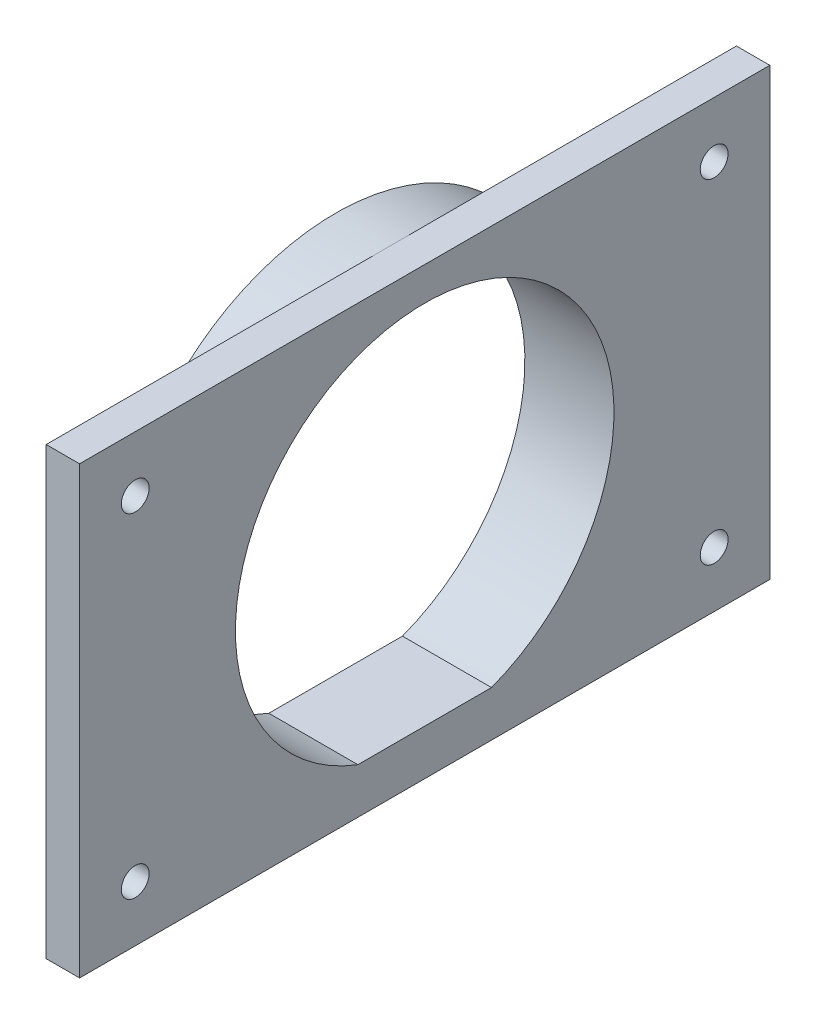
ISO-10303-21;
HEADER;
FILE_DESCRIPTION(('STEP AP214'),'2;1');
FILE_NAME('part.step','',(''),(''),'','','');
FILE_SCHEMA(('AUTOMOTIVE_DESIGN { 1 0 10303 214 1 1 1 1 }'));
ENDSEC;
DATA;
#1=APPLICATION_CONTEXT('core data for automotive mechanical design processes');
#2=APPLICATION_PROTOCOL_DEFINITION('international standard','automotive_design',2000,#1);
#3=PRODUCT_CONTEXT('',#1,'mechanical');
#4=PRODUCT('Part','Part','',(#3));
#5=PRODUCT_RELATED_PRODUCT_CATEGORY('part','',(#4));
#6=PRODUCT_DEFINITION_FORMATION('','',#4);
#7=PRODUCT_DEFINITION_CONTEXT('part definition',#1,'design');
#8=PRODUCT_DEFINITION('design','',#6,#7);
#9=PRODUCT_DEFINITION_SHAPE('','',#8);
#10=(LENGTH_UNIT() NAMED_UNIT(*) SI_UNIT(.MILLI.,.METRE.));
#11=(NAMED_UNIT(*) PLANE_ANGLE_UNIT() SI_UNIT($,.RADIAN.));
#12=(NAMED_UNIT(*) SI_UNIT($,.STERADIAN.) SOLID_ANGLE_UNIT());
#13=UNCERTAINTY_MEASURE_WITH_UNIT(LENGTH_MEASURE(1.E-05),#10,'distance_accuracy_value','');
#14=(GEOMETRIC_REPRESENTATION_CONTEXT(3) GLOBAL_UNCERTAINTY_ASSIGNED_CONTEXT((#13)) GLOBAL_UNIT_ASSIGNED_CONTEXT((#10,
#11,#12)) REPRESENTATION_CONTEXT('',''));
#15=CARTESIAN_POINT('',(0.,0.,0.));
#16=DIRECTION('',(0.,0.,1.));
#17=DIRECTION('',(1.,0.,0.));
#18=AXIS2_PLACEMENT_3D('',#15,#16,#17);
#19=CARTESIAN_POINT('',(-3.,0.,0.));
#20=DIRECTION('',(-1.,0.,0.));
#21=DIRECTION('',(0.,0.,1.));
#22=AXIS2_PLACEMENT_3D('',#19,#20,#21);
#23=PLANE('',#22);
#24=CARTESIAN_POINT('',(-3.,-15.,-26.));
#25=DIRECTION('',(-1.,0.,0.));
#26=DIRECTION('',(0.,0.,1.));
#27=AXIS2_PLACEMENT_3D('',#24,#25,#26);
#28=CIRCLE('',#27,2.25);
#29=CARTESIAN_POINT('',(-3.,-15.,-23.75));
#30=VERTEX_POINT('',#29);
#31=EDGE_CURVE('E168',#30,#30,#28,.F.);
#32=ORIENTED_EDGE('',*,*,#31,.T.);
#33=EDGE_LOOP('',(#32));
#34=FACE_BOUND('',#33,.T.);
#35=CARTESIAN_POINT('',(-3.,15.,-26.));
#36=DIRECTION('',(-1.,0.,0.));
#37=DIRECTION('',(0.,0.,1.));
#38=AXIS2_PLACEMENT_3D('',#35,#36,#37);
#39=CIRCLE('',#38,2.25);
#40=CARTESIAN_POINT('',(-3.,15.,-23.75));
#41=VERTEX_POINT('',#40);
#42=EDGE_CURVE('E165',#41,#41,#39,.F.);
#43=ORIENTED_EDGE('',*,*,#42,.T.);
#44=EDGE_LOOP('',(#43));
#45=FACE_BOUND('',#44,.T.);
#46=DIRECTION('',(0.,0.,-1.));
#47=VECTOR('',#46,1.);
#48=CARTESIAN_POINT('',(-3.,-20.,31.));
#49=LINE('',#48,#47);
#50=CARTESIAN_POINT('',(-3.,-20.,0.));
#51=VERTEX_POINT('',#50);
#52=CARTESIAN_POINT('',(-3.,-20.,-31.));
#53=VERTEX_POINT('',#52);
#54=EDGE_CURVE('E130',#51,#53,#49,.T.);
#55=ORIENTED_EDGE('',*,*,#54,.F.);
#56=CARTESIAN_POINT('',(-3.,0.,0.));
#57=DIRECTION('',(-1.,0.,0.));
#58=DIRECTION('',(0.,0.,1.));
#59=AXIS2_PLACEMENT_3D('',#56,#57,#58);
#60=CIRCLE('',#59,20.);
#61=CARTESIAN_POINT('',(-3.,20.,0.));
#62=VERTEX_POINT('',#61);
#63=EDGE_CURVE('E118',#51,#62,#60,.F.);
#64=ORIENTED_EDGE('',*,*,#63,.T.);
#65=DIRECTION('',(0.,0.,1.));
#66=VECTOR('',#65,1.);
#67=CARTESIAN_POINT('',(-3.,20.,31.));
#68=LINE('',#67,#66);
#69=CARTESIAN_POINT('',(-3.,20.,-31.));
#70=VERTEX_POINT('',#69);
#71=EDGE_CURVE('E124',#70,#62,#68,.T.);
#72=ORIENTED_EDGE('',*,*,#71,.F.);
#73=DIRECTION('',(0.,1.,0.));
#74=VECTOR('',#73,1.);
#75=CARTESIAN_POINT('',(-3.,-20.,-31.));
#76=LINE('',#75,#74);
#77=EDGE_CURVE('E119',#53,#70,#76,.T.);
#78=ORIENTED_EDGE('',*,*,#77,.F.);
#79=EDGE_LOOP('',(#55,#64,#72,#78));
#80=FACE_BOUND('',#79,.T.);
#81=ADVANCED_FACE('F33',(#34,#45,#80),#23,.T.);
#82=CARTESIAN_POINT('',(-3.,-20.,-31.));
#83=DIRECTION('',(0.,0.,-1.));
#84=DIRECTION('',(-1.,0.,0.));
#85=AXIS2_PLACEMENT_3D('',#82,#83,#84);
#86=PLANE('',#85);
#87=DIRECTION('',(0.,1.,0.));
#88=VECTOR('',#87,1.);
#89=CARTESIAN_POINT('',(0.,-20.,-31.));
#90=LINE('',#89,#88);
#91=CARTESIAN_POINT('',(0.,-20.,-31.));
#92=VERTEX_POINT('',#91);
#93=CARTESIAN_POINT('',(0.,20.,-31.));
#94=VERTEX_POINT('',#93);
#95=EDGE_CURVE('E135',#92,#94,#90,.T.);
#96=ORIENTED_EDGE('',*,*,#95,.F.);
#97=DIRECTION('',(1.,0.,0.));
#98=VECTOR('',#97,1.);
#99=CARTESIAN_POINT('',(-3.,-20.,-31.));
#100=LINE('',#99,#98);
#101=EDGE_CURVE('E144',#53,#92,#100,.T.);
#102=ORIENTED_EDGE('',*,*,#101,.F.);
#103=ORIENTED_EDGE('',*,*,#77,.T.);
#104=DIRECTION('',(1.,0.,0.));
#105=VECTOR('',#104,1.);
#106=CARTESIAN_POINT('',(-3.,20.,-31.));
#107=LINE('',#106,#105);
#108=EDGE_CURVE('E134',#70,#94,#107,.T.);
#109=ORIENTED_EDGE('',*,*,#108,.T.);
#110=EDGE_LOOP('',(#96,#102,#103,#109));
#111=FACE_BOUND('',#110,.T.);
#112=ADVANCED_FACE('F190',(#111),#86,.T.);
#113=CARTESIAN_POINT('',(-3.,-20.,31.));
#114=DIRECTION('',(0.,-1.,0.));
#115=DIRECTION('',(0.,0.,-1.));
#116=AXIS2_PLACEMENT_3D('',#113,#114,#115);
#117=PLANE('',#116);
#118=CARTESIAN_POINT('',(-3.,-20.,31.));
#119=VERTEX_POINT('',#118);
#120=EDGE_CURVE('E131',#119,#51,#49,.T.);
#121=ORIENTED_EDGE('',*,*,#120,.T.);
#122=ORIENTED_EDGE('',*,*,#54,.T.);
#123=ORIENTED_EDGE('',*,*,#101,.T.);
#124=DIRECTION('',(0.,0.,-1.));
#125=VECTOR('',#124,1.);
#126=CARTESIAN_POINT('',(0.,-20.,31.));
#127=LINE('',#126,#125);
#128=CARTESIAN_POINT('',(0.,-20.,31.));
#129=VERTEX_POINT('',#128);
#130=EDGE_CURVE('E123',#129,#92,#127,.T.);
#131=ORIENTED_EDGE('',*,*,#130,.F.);
#132=DIRECTION('',(1.,0.,0.));
#133=VECTOR('',#132,1.);
#134=CARTESIAN_POINT('',(-3.,-20.,31.));
#135=LINE('',#134,#133);
#136=EDGE_CURVE('E148',#119,#129,#135,.T.);
#137=ORIENTED_EDGE('',*,*,#136,.F.);
#138=EDGE_LOOP('',(#121,#122,#123,#131,#137));
#139=FACE_BOUND('',#138,.T.);
#140=ADVANCED_FACE('F197',(#139),#117,.T.);
#141=CARTESIAN_POINT('',(-3.,-20.,31.));
#142=DIRECTION('',(0.,0.,1.));
#143=DIRECTION('',(1.,0.,0.));
#144=AXIS2_PLACEMENT_3D('',#141,#142,#143);
#145=PLANE('',#144);
#146=DIRECTION('',(0.,-1.,0.));
#147=VECTOR('',#146,1.);
#148=CARTESIAN_POINT('',(0.,-20.,31.));
#149=LINE('',#148,#147);
#150=CARTESIAN_POINT('',(0.,20.,31.));
#151=VERTEX_POINT('',#150);
#152=EDGE_CURVE('E140',#151,#129,#149,.T.);
#153=ORIENTED_EDGE('',*,*,#152,.F.);
#154=DIRECTION('',(1.,0.,0.));
#155=VECTOR('',#154,1.);
#156=CARTESIAN_POINT('',(-3.,20.,31.));
#157=LINE('',#156,#155);
#158=CARTESIAN_POINT('',(-3.,20.,31.));
#159=VERTEX_POINT('',#158);
#160=EDGE_CURVE('E150',#159,#151,#157,.T.);
#161=ORIENTED_EDGE('',*,*,#160,.F.);
#162=DIRECTION('',(0.,-1.,0.));
#163=VECTOR('',#162,1.);
#164=CARTESIAN_POINT('',(-3.,-20.,31.));
#165=LINE('',#164,#163);
#166=EDGE_CURVE('E127',#159,#119,#165,.T.);
#167=ORIENTED_EDGE('',*,*,#166,.T.);
#168=ORIENTED_EDGE('',*,*,#136,.T.);
#169=EDGE_LOOP('',(#153,#161,#167,#168));
#170=FACE_BOUND('',#169,.T.);
#171=ADVANCED_FACE('F212',(#170),#145,.T.);
#172=CARTESIAN_POINT('',(-3.,20.,31.));
#173=DIRECTION('',(0.,1.,0.));
#174=DIRECTION('',(0.,0.,1.));
#175=AXIS2_PLACEMENT_3D('',#172,#173,#174);
#176=PLANE('',#175);
#177=ORIENTED_EDGE('',*,*,#71,.T.);
#178=EDGE_CURVE('E122',#62,#159,#68,.T.);
#179=ORIENTED_EDGE('',*,*,#178,.T.);
#180=ORIENTED_EDGE('',*,*,#160,.T.);
#181=DIRECTION('',(0.,0.,1.));
#182=VECTOR('',#181,1.);
#183=CARTESIAN_POINT('',(0.,20.,31.));
#184=LINE('',#183,#182);
#185=EDGE_CURVE('E138',#94,#151,#184,.T.);
#186=ORIENTED_EDGE('',*,*,#185,.F.);
#187=ORIENTED_EDGE('',*,*,#108,.F.);
#188=EDGE_LOOP('',(#177,#179,#180,#186,#187));
#189=FACE_BOUND('',#188,.T.);
#190=ADVANCED_FACE('F204',(#189),#176,.T.);
#191=CARTESIAN_POINT('',(-3.,-15.,26.));
#192=DIRECTION('',(-1.,0.,0.));
#193=DIRECTION('',(0.,0.,1.));
#194=AXIS2_PLACEMENT_3D('',#191,#192,#193);
#195=CIRCLE('',#194,2.25);
#196=CARTESIAN_POINT('',(-3.,-15.,28.25));
#197=VERTEX_POINT('',#196);
#198=EDGE_CURVE('E159',#197,#197,#195,.F.);
#199=ORIENTED_EDGE('',*,*,#198,.T.);
#200=EDGE_LOOP('',(#199));
#201=FACE_BOUND('',#200,.T.);
#202=CARTESIAN_POINT('',(-3.,15.,26.));
#203=DIRECTION('',(-1.,0.,0.));
#204=DIRECTION('',(0.,0.,1.));
#205=AXIS2_PLACEMENT_3D('',#202,#203,#204);
#206=CIRCLE('',#205,2.25);
#207=CARTESIAN_POINT('',(-3.,15.,28.25));
#208=VERTEX_POINT('',#207);
#209=EDGE_CURVE('E156',#208,#208,#206,.F.);
#210=ORIENTED_EDGE('',*,*,#209,.T.);
#211=EDGE_LOOP('',(#210));
#212=FACE_BOUND('',#211,.T.);
#213=ORIENTED_EDGE('',*,*,#178,.F.);
#214=EDGE_CURVE('E115',#62,#51,#60,.F.);
#215=ORIENTED_EDGE('',*,*,#214,.T.);
#216=ORIENTED_EDGE('',*,*,#120,.F.);
#217=ORIENTED_EDGE('',*,*,#166,.F.);
#218=EDGE_LOOP('',(#213,#215,#216,#217));
#219=FACE_BOUND('',#218,.T.);
#220=ADVANCED_FACE('F193',(#201,#212,#219),#23,.T.);
#221=CARTESIAN_POINT('',(0.,0.,0.));
#222=DIRECTION('',(-1.,0.,0.));
#223=DIRECTION('',(0.,0.,1.));
#224=AXIS2_PLACEMENT_3D('',#221,#222,#223);
#225=PLANE('',#224);
#226=CARTESIAN_POINT('',(0.,15.,26.));
#227=DIRECTION('',(-1.,0.,0.));
#228=DIRECTION('',(0.,0.,1.));
#229=AXIS2_PLACEMENT_3D('',#226,#227,#228);
#230=CIRCLE('',#229,1.25);
#231=CARTESIAN_POINT('',(0.,15.,27.25));
#232=VERTEX_POINT('',#231);
#233=EDGE_CURVE('E259',#232,#232,#230,.T.);
#234=ORIENTED_EDGE('',*,*,#233,.T.);
#235=EDGE_LOOP('',(#234));
#236=FACE_BOUND('',#235,.T.);
#237=CARTESIAN_POINT('',(0.,-15.,26.));
#238=DIRECTION('',(-1.,0.,0.));
#239=DIRECTION('',(0.,0.,1.));
#240=AXIS2_PLACEMENT_3D('',#237,#238,#239);
#241=CIRCLE('',#240,1.25);
#242=CARTESIAN_POINT('',(0.,-15.,27.25));
#243=VERTEX_POINT('',#242);
#244=EDGE_CURVE('E257',#243,#243,#241,.T.);
#245=ORIENTED_EDGE('',*,*,#244,.T.);
#246=EDGE_LOOP('',(#245));
#247=FACE_BOUND('',#246,.T.);
#248=CARTESIAN_POINT('',(0.,-15.,-26.));
#249=DIRECTION('',(-1.,0.,0.));
#250=DIRECTION('',(0.,0.,1.));
#251=AXIS2_PLACEMENT_3D('',#248,#249,#250);
#252=CIRCLE('',#251,1.25);
#253=CARTESIAN_POINT('',(0.,-15.,-24.75));
#254=VERTEX_POINT('',#253);
#255=EDGE_CURVE('E260',#254,#254,#252,.T.);
#256=ORIENTED_EDGE('',*,*,#255,.T.);
#257=EDGE_LOOP('',(#256));
#258=FACE_BOUND('',#257,.T.);
#259=CARTESIAN_POINT('',(0.,15.,-26.));
#260=DIRECTION('',(-1.,0.,0.));
#261=DIRECTION('',(0.,0.,1.));
#262=AXIS2_PLACEMENT_3D('',#259,#260,#261);
#263=CIRCLE('',#262,1.25);
#264=CARTESIAN_POINT('',(0.,15.,-24.75));
#265=VERTEX_POINT('',#264);
#266=EDGE_CURVE('E107',#265,#265,#263,.T.);
#267=ORIENTED_EDGE('',*,*,#266,.T.);
#268=EDGE_LOOP('',(#267));
#269=FACE_BOUND('',#268,.T.);
#270=DIRECTION('',(0.,0.,1.));
#271=VECTOR('',#270,1.);
#272=CARTESIAN_POINT('',(0.,-15.9059737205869,6.));
#273=LINE('',#272,#271);
#274=CARTESIAN_POINT('',(0.,-15.9059737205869,-6.));
#275=VERTEX_POINT('',#274);
#276=CARTESIAN_POINT('',(0.,-15.9059737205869,6.));
#277=VERTEX_POINT('',#276);
#278=EDGE_CURVE('E95',#275,#277,#273,.T.);
#279=ORIENTED_EDGE('',*,*,#278,.T.);
#280=CARTESIAN_POINT('',(0.,0.,0.));
#281=DIRECTION('',(-1.,0.,0.));
#282=DIRECTION('',(0.,0.,1.));
#283=AXIS2_PLACEMENT_3D('',#280,#281,#282);
#284=CIRCLE('',#283,17.);
#285=EDGE_CURVE('E48',#277,#275,#284,.T.);
#286=ORIENTED_EDGE('',*,*,#285,.T.);
#287=EDGE_LOOP('',(#279,#286));
#288=FACE_BOUND('',#287,.T.);
#289=ORIENTED_EDGE('',*,*,#130,.T.);
#290=ORIENTED_EDGE('',*,*,#95,.T.);
#291=ORIENTED_EDGE('',*,*,#185,.T.);
#292=ORIENTED_EDGE('',*,*,#152,.T.);
#293=EDGE_LOOP('',(#289,#290,#291,#292));
#294=FACE_BOUND('',#293,.T.);
#295=ADVANCED_FACE('F101',(#236,#247,#258,#269,#288,#294),#225,.F.);
#296=CARTESIAN_POINT('',(-8.,0.,0.));
#297=DIRECTION('',(1.,0.,0.));
#298=DIRECTION('',(0.,0.,-1.));
#299=AXIS2_PLACEMENT_3D('',#296,#297,#298);
#300=CYLINDRICAL_SURFACE('',#299,20.);
#301=ORIENTED_EDGE('',*,*,#63,.F.);
#302=ORIENTED_EDGE('',*,*,#214,.F.);
#303=EDGE_LOOP('',(#301,#302));
#304=FACE_BOUND('',#303,.T.);
#305=CARTESIAN_POINT('',(-8.,0.,0.));
#306=DIRECTION('',(-1.,0.,0.));
#307=DIRECTION('',(0.,0.,1.));
#308=AXIS2_PLACEMENT_3D('',#305,#306,#307);
#309=CIRCLE('',#308,20.);
#310=CARTESIAN_POINT('',(-8.,0.,20.));
#311=VERTEX_POINT('',#310);
#312=EDGE_CURVE('E111',#311,#311,#309,.T.);
#313=ORIENTED_EDGE('',*,*,#312,.F.);
#314=EDGE_LOOP('',(#313));
#315=FACE_BOUND('',#314,.T.);
#316=ADVANCED_FACE('F210',(#304,#315),#300,.T.);
#317=CARTESIAN_POINT('',(-8.,0.,0.));
#318=DIRECTION('',(-1.,0.,0.));
#319=DIRECTION('',(0.,0.,1.));
#320=AXIS2_PLACEMENT_3D('',#317,#318,#319);
#321=PLANE('',#320);
#322=CARTESIAN_POINT('',(-8.,0.,0.));
#323=DIRECTION('',(-1.,0.,0.));
#324=DIRECTION('',(0.,0.,1.));
#325=AXIS2_PLACEMENT_3D('',#322,#323,#324);
#326=CIRCLE('',#325,17.);
#327=CARTESIAN_POINT('',(-8.,-15.9059737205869,6.));
#328=VERTEX_POINT('',#327);
#329=CARTESIAN_POINT('',(-8.,-15.9059737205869,-6.));
#330=VERTEX_POINT('',#329);
#331=EDGE_CURVE('E53',#328,#330,#326,.T.);
#332=ORIENTED_EDGE('',*,*,#331,.F.);
#333=DIRECTION('',(0.,0.,1.));
#334=VECTOR('',#333,1.);
#335=CARTESIAN_POINT('',(-8.,-15.9059737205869,6.));
#336=LINE('',#335,#334);
#337=EDGE_CURVE('E103',#330,#328,#336,.T.);
#338=ORIENTED_EDGE('',*,*,#337,.F.);
#339=EDGE_LOOP('',(#332,#338));
#340=FACE_BOUND('',#339,.T.);
#341=ORIENTED_EDGE('',*,*,#312,.T.);
#342=EDGE_LOOP('',(#341));
#343=FACE_BOUND('',#342,.T.);
#344=ADVANCED_FACE('F283',(#340,#343),#321,.T.);
#345=CARTESIAN_POINT('',(0.,0.,0.));
#346=DIRECTION('',(-1.,0.,0.));
#347=DIRECTION('',(0.,0.,1.));
#348=AXIS2_PLACEMENT_3D('',#345,#346,#347);
#349=CYLINDRICAL_SURFACE('',#348,17.);
#350=ORIENTED_EDGE('',*,*,#331,.T.);
#351=DIRECTION('',(-1.,0.,0.));
#352=VECTOR('',#351,1.);
#353=CARTESIAN_POINT('',(0.,-15.9059737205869,-6.));
#354=LINE('',#353,#352);
#355=EDGE_CURVE('E88',#275,#330,#354,.T.);
#356=ORIENTED_EDGE('',*,*,#355,.F.);
#357=ORIENTED_EDGE('',*,*,#285,.F.);
#358=DIRECTION('',(-1.,0.,0.));
#359=VECTOR('',#358,1.);
#360=CARTESIAN_POINT('',(0.,-15.9059737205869,6.));
#361=LINE('',#360,#359);
#362=EDGE_CURVE('E94',#277,#328,#361,.T.);
#363=ORIENTED_EDGE('',*,*,#362,.T.);
#364=EDGE_LOOP('',(#350,#356,#357,#363));
#365=FACE_BOUND('',#364,.T.);
#366=ADVANCED_FACE('F90',(#365),#349,.F.);
#367=CARTESIAN_POINT('',(0.,-15.9059737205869,6.));
#368=DIRECTION('',(0.,-1.,0.));
#369=DIRECTION('',(0.,0.,-1.));
#370=AXIS2_PLACEMENT_3D('',#367,#368,#369);
#371=PLANE('',#370);
#372=ORIENTED_EDGE('',*,*,#337,.T.);
#373=ORIENTED_EDGE('',*,*,#362,.F.);
#374=ORIENTED_EDGE('',*,*,#278,.F.);
#375=ORIENTED_EDGE('',*,*,#355,.T.);
#376=EDGE_LOOP('',(#372,#373,#374,#375));
#377=FACE_BOUND('',#376,.T.);
#378=ADVANCED_FACE('F98',(#377),#371,.F.);
#379=CARTESIAN_POINT('',(0.,15.,-26.));
#380=DIRECTION('',(-1.,0.,0.));
#381=DIRECTION('',(0.,0.,1.));
#382=AXIS2_PLACEMENT_3D('',#379,#380,#381);
#383=CYLINDRICAL_SURFACE('',#382,1.25);
#384=CARTESIAN_POINT('',(-2.00000000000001,15.,-26.));
#385=DIRECTION('',(-1.,0.,0.));
#386=DIRECTION('',(0.,0.,1.));
#387=AXIS2_PLACEMENT_3D('',#384,#385,#386);
#388=CIRCLE('',#387,1.25);
#389=CARTESIAN_POINT('',(-2.00000000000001,15.,-24.75));
#390=VERTEX_POINT('',#389);
#391=EDGE_CURVE('E11',#390,#390,#388,.T.);
#392=ORIENTED_EDGE('',*,*,#391,.T.);
#393=EDGE_LOOP('',(#392));
#394=FACE_BOUND('',#393,.T.);
#395=ORIENTED_EDGE('',*,*,#266,.F.);
#396=EDGE_LOOP('',(#395));
#397=FACE_BOUND('',#396,.T.);
#398=ADVANCED_FACE('F270',(#394,#397),#383,.F.);
#399=CARTESIAN_POINT('',(0.,-15.,-26.));
#400=DIRECTION('',(-1.,0.,0.));
#401=DIRECTION('',(0.,0.,1.));
#402=AXIS2_PLACEMENT_3D('',#399,#400,#401);
#403=CYLINDRICAL_SURFACE('',#402,1.25);
#404=CARTESIAN_POINT('',(-2.00000000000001,-15.,-26.));
#405=DIRECTION('',(-1.,0.,0.));
#406=DIRECTION('',(0.,0.,1.));
#407=AXIS2_PLACEMENT_3D('',#404,#405,#406);
#408=CIRCLE('',#407,1.25);
#409=CARTESIAN_POINT('',(-2.00000000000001,-15.,-24.75));
#410=VERTEX_POINT('',#409);
#411=EDGE_CURVE('E162',#410,#410,#408,.T.);
#412=ORIENTED_EDGE('',*,*,#411,.T.);
#413=EDGE_LOOP('',(#412));
#414=FACE_BOUND('',#413,.T.);
#415=ORIENTED_EDGE('',*,*,#255,.F.);
#416=EDGE_LOOP('',(#415));
#417=FACE_BOUND('',#416,.T.);
#418=ADVANCED_FACE('F253',(#414,#417),#403,.F.);
#419=CARTESIAN_POINT('',(0.,-15.,26.));
#420=DIRECTION('',(-1.,0.,0.));
#421=DIRECTION('',(0.,0.,1.));
#422=AXIS2_PLACEMENT_3D('',#419,#420,#421);
#423=CYLINDRICAL_SURFACE('',#422,1.25);
#424=CARTESIAN_POINT('',(-2.00000000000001,-15.,26.));
#425=DIRECTION('',(-1.,0.,0.));
#426=DIRECTION('',(0.,0.,1.));
#427=AXIS2_PLACEMENT_3D('',#424,#425,#426);
#428=CIRCLE('',#427,1.25);
#429=CARTESIAN_POINT('',(-2.00000000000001,-15.,27.25));
#430=VERTEX_POINT('',#429);
#431=EDGE_CURVE('E147',#430,#430,#428,.T.);
#432=ORIENTED_EDGE('',*,*,#431,.T.);
#433=EDGE_LOOP('',(#432));
#434=FACE_BOUND('',#433,.T.);
#435=ORIENTED_EDGE('',*,*,#244,.F.);
#436=EDGE_LOOP('',(#435));
#437=FACE_BOUND('',#436,.T.);
#438=ADVANCED_FACE('F246',(#434,#437),#423,.F.);
#439=CARTESIAN_POINT('',(0.,15.,26.));
#440=DIRECTION('',(-1.,0.,0.));
#441=DIRECTION('',(0.,0.,1.));
#442=AXIS2_PLACEMENT_3D('',#439,#440,#441);
#443=CYLINDRICAL_SURFACE('',#442,1.25);
#444=CARTESIAN_POINT('',(-2.00000000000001,15.,26.));
#445=DIRECTION('',(-1.,0.,0.));
#446=DIRECTION('',(0.,0.,1.));
#447=AXIS2_PLACEMENT_3D('',#444,#445,#446);
#448=CIRCLE('',#447,1.25);
#449=CARTESIAN_POINT('',(-2.00000000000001,15.,27.25));
#450=VERTEX_POINT('',#449);
#451=EDGE_CURVE('E41',#450,#450,#448,.T.);
#452=ORIENTED_EDGE('',*,*,#451,.T.);
#453=EDGE_LOOP('',(#452));
#454=FACE_BOUND('',#453,.T.);
#455=ORIENTED_EDGE('',*,*,#233,.F.);
#456=EDGE_LOOP('',(#455));
#457=FACE_BOUND('',#456,.T.);
#458=ADVANCED_FACE('F173',(#454,#457),#443,.F.);
#459=CARTESIAN_POINT('',(-2.00000000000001,-15.,26.));
#460=DIRECTION('',(-1.,0.,0.));
#461=DIRECTION('',(0.,0.,1.));
#462=AXIS2_PLACEMENT_3D('',#459,#460,#461);
#463=CONICAL_SURFACE('',#462,1.25,0.78539816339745);
#464=ORIENTED_EDGE('',*,*,#198,.F.);
#465=EDGE_LOOP('',(#464));
#466=FACE_BOUND('',#465,.T.);
#467=ORIENTED_EDGE('',*,*,#431,.F.);
#468=EDGE_LOOP('',(#467));
#469=FACE_BOUND('',#468,.T.);
#470=ADVANCED_FACE('F185',(#466,#469),#463,.F.);
#471=CARTESIAN_POINT('',(-2.00000000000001,-15.,-26.));
#472=DIRECTION('',(-1.,0.,0.));
#473=DIRECTION('',(0.,0.,1.));
#474=AXIS2_PLACEMENT_3D('',#471,#472,#473);
#475=CONICAL_SURFACE('',#474,1.25,0.78539816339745);
#476=ORIENTED_EDGE('',*,*,#31,.F.);
#477=EDGE_LOOP('',(#476));
#478=FACE_BOUND('',#477,.T.);
#479=ORIENTED_EDGE('',*,*,#411,.F.);
#480=EDGE_LOOP('',(#479));
#481=FACE_BOUND('',#480,.T.);
#482=ADVANCED_FACE('F178',(#478,#481),#475,.F.);
#483=CARTESIAN_POINT('',(-2.00000000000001,15.,26.));
#484=DIRECTION('',(-1.,0.,0.));
#485=DIRECTION('',(0.,0.,1.));
#486=AXIS2_PLACEMENT_3D('',#483,#484,#485);
#487=CONICAL_SURFACE('',#486,1.25,0.78539816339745);
#488=ORIENTED_EDGE('',*,*,#209,.F.);
#489=EDGE_LOOP('',(#488));
#490=FACE_BOUND('',#489,.T.);
#491=ORIENTED_EDGE('',*,*,#451,.F.);
#492=EDGE_LOOP('',(#491));
#493=FACE_BOUND('',#492,.T.);
#494=ADVANCED_FACE('F176',(#490,#493),#487,.F.);
#495=CARTESIAN_POINT('',(-2.00000000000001,15.,-26.));
#496=DIRECTION('',(-1.,0.,0.));
#497=DIRECTION('',(0.,0.,1.));
#498=AXIS2_PLACEMENT_3D('',#495,#496,#497);
#499=CONICAL_SURFACE('',#498,1.25,0.78539816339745);
#500=ORIENTED_EDGE('',*,*,#42,.F.);
#501=EDGE_LOOP('',(#500));
#502=FACE_BOUND('',#501,.T.);
#503=ORIENTED_EDGE('',*,*,#391,.F.);
#504=EDGE_LOOP('',(#503));
#505=FACE_BOUND('',#504,.T.);
#506=ADVANCED_FACE('F35',(#502,#505),#499,.F.);
#507=CLOSED_SHELL('',(#81,#112,#140,#171,#190,#220,#295,#316,#344,#366,#378,#398,#418,#438,#458,
#470,#482,#494,#506));
#508=MANIFOLD_SOLID_BREP('B2',#507);
#509=ADVANCED_BREP_SHAPE_REPRESENTATION('',(#18,#508),#14);
#510=SHAPE_DEFINITION_REPRESENTATION(#9,#509);
ENDSEC;
END-ISO-10303-21;
